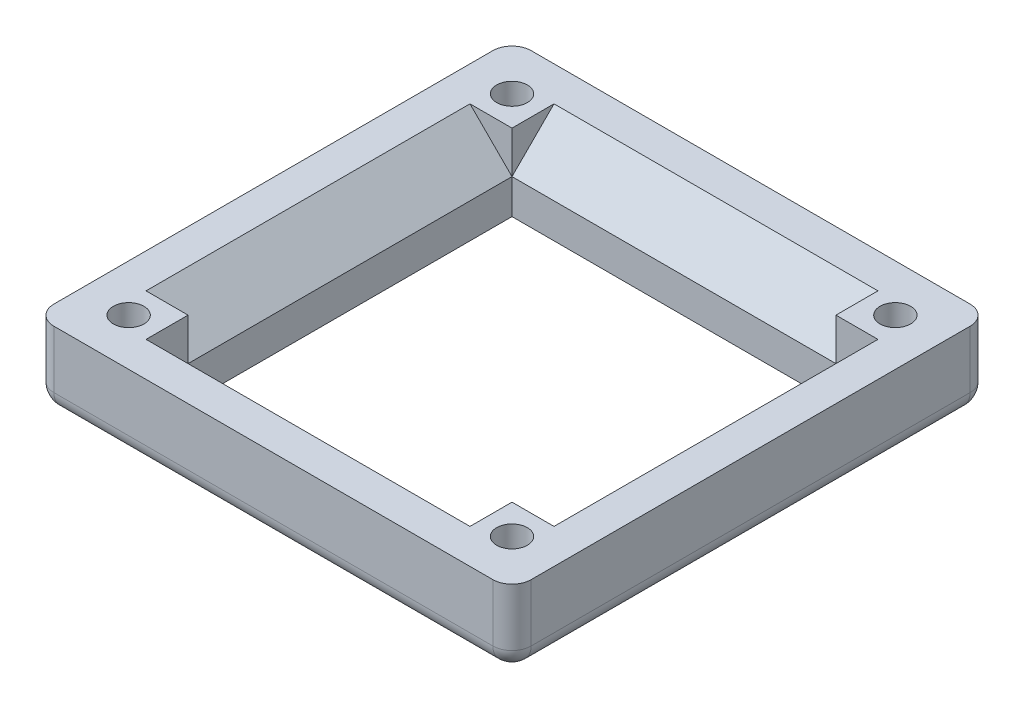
from build123d import *

# Parameters (mm, degrees)
SKIZZE1_W                            = 49.8
SKIZZE1_H                            = 49.8
AUFSATZ_LINEAR_AUSTRAGEN1_DEPTH      = 8
VERRUNDUNG1_R                        = 2
SCHNITT_LINEAR_AUSTRAGEN2_DEPTH      = 37.111217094
SCHNITT_LINEAR_AUSTRAGEN2_DEPTH_BACK = 37.111217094
SKIZZE2_W                            = 33.8
SKIZZE2_H                            = 33.8
SCHNITT_LINEAR_AUSTRAGEN3_DEPTH      = 33.8
SCHNITT_LINEAR_AUSTRAGEN4_DEPTH      = 33.8
SCHNITT_LINEAR_AUSTRAGEN5_DEPTH      = 37.111217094
SCHNITT_LINEAR_AUSTRAGEN5_DEPTH_BACK = 37.111217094
SKIZZE5_R                            = 1.6
SKIZZE5_4_R                          = 3
SCHNITT_LINEAR_AUSTRAGEN6_DEPTH      = 2.5


with BuildPart() as part:
    # Skizze1 → Aufsatz-Linear austragen1 (new body)
    with BuildSketch(Plane(origin=(0, 0, 0), x_dir=(1, 0, 0), z_dir=(0, 1, 0))):
        Rectangle(SKIZZE1_W, SKIZZE1_H)
    extrude(amount=AUFSATZ_LINEAR_AUSTRAGEN1_DEPTH)

    # Verrundung1
    verrundung1_edges = [part.edges().sort_by_distance(p)[0] for p in [
        (0, 0, -24.9),
        (24.9, 0, 0),
        (0, 0, 24.9),
        (-24.9, 0, 0),
        (-24.9, 4, -24.9),
        (24.9, 4, -24.9),
        (24.9, 4, 24.9),
        (-24.9, 4, 24.9),
    ]]
    fillet(verrundung1_edges, radius=VERRUNDUNG1_R)

    # Skizze2 → Schnitt-Linear austragen2 (cut, two sides: drawn at the far end of the back side and taken through both)
    with BuildSketch(Plane(origin=(0, 0, 0), x_dir=(1, 0, 0), z_dir=(0, 1, 0)).offset(-SCHNITT_LINEAR_AUSTRAGEN2_DEPTH_BACK)):
        Rectangle(SKIZZE2_W, SKIZZE2_H)
    extrude(amount=SCHNITT_LINEAR_AUSTRAGEN2_DEPTH + SCHNITT_LINEAR_AUSTRAGEN2_DEPTH_BACK, mode=Mode.SUBTRACT)

    # Skizze3 → Schnitt-Linear austragen3 (cut)
    with BuildSketch(Plane.XY.offset(-16.9)):
        Polygon((-16.9, 8), (-16.9, 3.615937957), (-21.284062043, 8), align=None)
        Polygon((21.284062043, 8), (16.9, 8), (16.9, 3.615937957), align=None)
    extrude(amount=SCHNITT_LINEAR_AUSTRAGEN3_DEPTH, mode=Mode.SUBTRACT)

    # Skizze4 → Schnitt-Linear austragen4 (cut)
    with BuildSketch(Plane.ZY.offset(-16.9)):
        Polygon((-16.9, 8), (-16.9, 3.615937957), (-21.284062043, 8), align=None)
        Polygon((21.284062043, 8), (16.9, 8), (16.9, 3.615937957), align=None)
    extrude(amount=SCHNITT_LINEAR_AUSTRAGEN4_DEPTH, mode=Mode.SUBTRACT)

    # Skizze5 → Schnitt-Linear austragen5 (cut, two sides: drawn at the far end of the back side and taken through both)
    with BuildSketch(Plane.XZ.offset(-SCHNITT_LINEAR_AUSTRAGEN5_DEPTH_BACK)):
        with Locations(Location((-20, 20, 0), (0, 0, 270))):
            Circle(SKIZZE5_R)
        with Locations(Location((20, 20, 0), (0, 0, 270))):
            Circle(SKIZZE5_R)
        with Locations(Location((20, -20, 0), (0, 0, 270))):
            Circle(SKIZZE5_R)
        with Locations(Location((-20, -20, 0), (0, 0, 270))):
            Circle(SKIZZE5_R)
    extrude(amount=SCHNITT_LINEAR_AUSTRAGEN5_DEPTH + SCHNITT_LINEAR_AUSTRAGEN5_DEPTH_BACK, mode=Mode.SUBTRACT)

    # Skizze5_4 → Schnitt-Linear austragen6 (cut)
    with BuildSketch(Plane.XZ):
        with Locations(Location((-20, 20, 0), (0, 0, 270))):
            Circle(SKIZZE5_4_R)
        with Locations(Location((20, 20, 0), (0, 0, 270))):
            Circle(SKIZZE5_4_R)
        with Locations(Location((20, -20, 0), (0, 0, 270))):
            Circle(SKIZZE5_4_R)
        with Locations(Location((-20, -20, 0), (0, 0, 270))):
            Circle(SKIZZE5_4_R)
    extrude(amount=-SCHNITT_LINEAR_AUSTRAGEN6_DEPTH, mode=Mode.SUBTRACT)


solid = part.part
